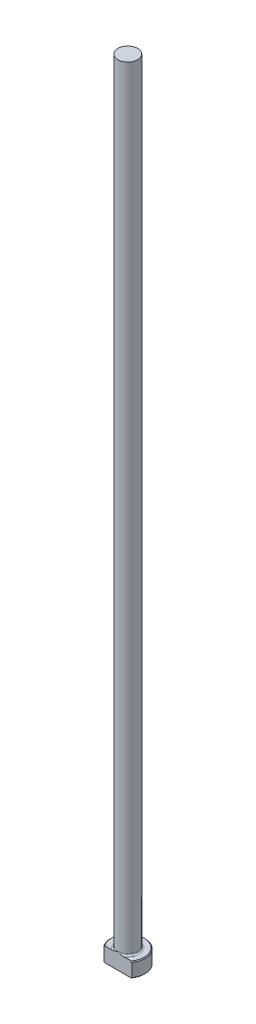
ISO-10303-21;
HEADER;
FILE_DESCRIPTION(('STEP AP214'),'2;1');
FILE_NAME('part.step','',(''),(''),'','','');
FILE_SCHEMA(('AUTOMOTIVE_DESIGN { 1 0 10303 214 1 1 1 1 }'));
ENDSEC;
DATA;
#1=APPLICATION_CONTEXT('core data for automotive mechanical design processes');
#2=APPLICATION_PROTOCOL_DEFINITION('international standard','automotive_design',2000,#1);
#3=PRODUCT_CONTEXT('',#1,'mechanical');
#4=PRODUCT('Part','Part','',(#3));
#5=PRODUCT_RELATED_PRODUCT_CATEGORY('part','',(#4));
#6=PRODUCT_DEFINITION_FORMATION('','',#4);
#7=PRODUCT_DEFINITION_CONTEXT('part definition',#1,'design');
#8=PRODUCT_DEFINITION('design','',#6,#7);
#9=PRODUCT_DEFINITION_SHAPE('','',#8);
#10=(LENGTH_UNIT() NAMED_UNIT(*) SI_UNIT(.MILLI.,.METRE.));
#11=(NAMED_UNIT(*) PLANE_ANGLE_UNIT() SI_UNIT($,.RADIAN.));
#12=(NAMED_UNIT(*) SI_UNIT($,.STERADIAN.) SOLID_ANGLE_UNIT());
#13=UNCERTAINTY_MEASURE_WITH_UNIT(LENGTH_MEASURE(1.E-05),#10,'distance_accuracy_value','');
#14=(GEOMETRIC_REPRESENTATION_CONTEXT(3) GLOBAL_UNCERTAINTY_ASSIGNED_CONTEXT((#13)) GLOBAL_UNIT_ASSIGNED_CONTEXT((#10,
#11,#12)) REPRESENTATION_CONTEXT('',''));
#15=CARTESIAN_POINT('',(0.,0.,0.));
#16=DIRECTION('',(0.,0.,1.));
#17=DIRECTION('',(1.,0.,0.));
#18=AXIS2_PLACEMENT_3D('',#15,#16,#17);
#19=CARTESIAN_POINT('',(0.,0.,0.));
#20=DIRECTION('',(0.,-1.,0.));
#21=DIRECTION('',(0.,0.,-1.));
#22=AXIS2_PLACEMENT_3D('',#19,#20,#21);
#23=PLANE('',#22);
#24=CARTESIAN_POINT('',(0.,0.,0.));
#25=DIRECTION('',(0.,-1.,0.));
#26=DIRECTION('',(0.,0.,-1.));
#27=AXIS2_PLACEMENT_3D('',#24,#25,#26);
#28=CIRCLE('',#27,5.29589999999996);
#29=CARTESIAN_POINT('',(-4.23862381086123,0.,3.17499999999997));
#30=VERTEX_POINT('',#29);
#31=CARTESIAN_POINT('',(4.23862381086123,0.,3.17499999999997));
#32=VERTEX_POINT('',#31);
#33=EDGE_CURVE('E98',#30,#32,#28,.T.);
#34=ORIENTED_EDGE('',*,*,#33,.T.);
#35=DIRECTION('',(-1.,0.,0.));
#36=VECTOR('',#35,1.);
#37=CARTESIAN_POINT('',(-4.55200670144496,0.,3.17499999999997));
#38=LINE('',#37,#36);
#39=EDGE_CURVE('E83',#32,#30,#38,.T.);
#40=ORIENTED_EDGE('',*,*,#39,.T.);
#41=EDGE_LOOP('',(#34,#40));
#42=FACE_BOUND('',#41,.T.);
#43=ADVANCED_FACE('F32',(#42),#23,.T.);
#44=CARTESIAN_POINT('',(0.,259.958771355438,0.));
#45=DIRECTION('',(0.,1.,0.));
#46=DIRECTION('',(0.,0.,1.));
#47=AXIS2_PLACEMENT_3D('',#44,#45,#46);
#48=CYLINDRICAL_SURFACE('',#47,5.54989999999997);
#49=CARTESIAN_POINT('',(0.,4.49580000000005,0.));
#50=DIRECTION('',(0.,1.,0.));
#51=DIRECTION('',(0.,0.,1.));
#52=AXIS2_PLACEMENT_3D('',#49,#50,#51);
#53=CIRCLE('',#52,5.54989999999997);
#54=CARTESIAN_POINT('',(-4.55200670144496,4.49580000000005,3.17499999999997));
#55=VERTEX_POINT('',#54);
#56=CARTESIAN_POINT('',(4.55200670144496,4.49580000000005,3.17499999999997));
#57=VERTEX_POINT('',#56);
#58=EDGE_CURVE('E104',#55,#57,#53,.F.);
#59=ORIENTED_EDGE('',*,*,#58,.T.);
#60=DIRECTION('',(0.,-1.,0.));
#61=VECTOR('',#60,1.);
#62=CARTESIAN_POINT('',(4.55200670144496,254.,3.17499999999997));
#63=LINE('',#62,#61);
#64=CARTESIAN_POINT('',(4.55200670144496,0.253999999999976,3.17499999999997));
#65=VERTEX_POINT('',#64);
#66=EDGE_CURVE('E183',#57,#65,#63,.T.);
#67=ORIENTED_EDGE('',*,*,#66,.T.);
#68=CARTESIAN_POINT('',(0.,0.253999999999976,0.));
#69=DIRECTION('',(0.,-1.,0.));
#70=DIRECTION('',(0.,0.,-1.));
#71=AXIS2_PLACEMENT_3D('',#68,#69,#70);
#72=CIRCLE('',#71,5.54989999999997);
#73=CARTESIAN_POINT('',(-4.55200670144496,0.253999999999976,3.17499999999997));
#74=VERTEX_POINT('',#73);
#75=EDGE_CURVE('E100',#65,#74,#72,.F.);
#76=ORIENTED_EDGE('',*,*,#75,.T.);
#77=DIRECTION('',(0.,-1.,0.));
#78=VECTOR('',#77,1.);
#79=CARTESIAN_POINT('',(-4.55200670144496,254.,3.17499999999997));
#80=LINE('',#79,#78);
#81=EDGE_CURVE('E93',#55,#74,#80,.T.);
#82=ORIENTED_EDGE('',*,*,#81,.F.);
#83=EDGE_LOOP('',(#59,#67,#76,#82));
#84=FACE_BOUND('',#83,.T.);
#85=ADVANCED_FACE('F158',(#84),#48,.T.);
#86=CARTESIAN_POINT('',(-5.54989999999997,4.7498,0.));
#87=DIRECTION('',(0.,1.,0.));
#88=DIRECTION('',(0.,0.,1.));
#89=AXIS2_PLACEMENT_3D('',#86,#87,#88);
#90=PLANE('',#89);
#91=CARTESIAN_POINT('',(0.,4.7498,0.));
#92=DIRECTION('',(0.,1.,0.));
#93=DIRECTION('',(0.,0.,1.));
#94=AXIS2_PLACEMENT_3D('',#91,#92,#93);
#95=CIRCLE('',#94,5.29590000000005);
#96=CARTESIAN_POINT('',(4.23862381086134,4.7498,3.17499999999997));
#97=VERTEX_POINT('',#96);
#98=CARTESIAN_POINT('',(-4.23862381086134,4.7498,3.17499999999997));
#99=VERTEX_POINT('',#98);
#100=EDGE_CURVE('E178',#97,#99,#95,.T.);
#101=ORIENTED_EDGE('',*,*,#100,.T.);
#102=DIRECTION('',(1.,0.,0.));
#103=VECTOR('',#102,1.);
#104=CARTESIAN_POINT('',(-5.54989999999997,4.7498,3.17499999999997));
#105=LINE('',#104,#103);
#106=CARTESIAN_POINT('',(-1.86651118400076,4.74979999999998,3.17499999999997));
#107=VERTEX_POINT('',#106);
#108=EDGE_CURVE('E57',#99,#107,#105,.T.);
#109=ORIENTED_EDGE('',*,*,#108,.T.);
#110=CARTESIAN_POINT('',(0.,4.7498,0.));
#111=DIRECTION('',(0.,1.,0.));
#112=DIRECTION('',(0.,0.,1.));
#113=AXIS2_PLACEMENT_3D('',#110,#111,#112);
#114=CIRCLE('',#113,3.68299999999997);
#115=CARTESIAN_POINT('',(1.86651118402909,4.74979999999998,3.17499999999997));
#116=VERTEX_POINT('',#115);
#117=EDGE_CURVE('E107',#107,#116,#114,.F.);
#118=ORIENTED_EDGE('',*,*,#117,.T.);
#119=EDGE_CURVE('E136',#116,#97,#105,.T.);
#120=ORIENTED_EDGE('',*,*,#119,.T.);
#121=EDGE_LOOP('',(#101,#109,#118,#120));
#122=FACE_BOUND('',#121,.T.);
#123=ADVANCED_FACE('F147',(#122),#90,.T.);
#124=CARTESIAN_POINT('',(0.,4.74980000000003,0.));
#125=DIRECTION('',(0.,-1.,0.));
#126=DIRECTION('',(0.,0.,-1.));
#127=AXIS2_PLACEMENT_3D('',#124,#125,#126);
#128=CONICAL_SURFACE('',#127,5.29590000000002,0.785398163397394);
#129=ORIENTED_EDGE('',*,*,#58,.F.);
#130=CARTESIAN_POINT('',(-10.0167402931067,-0.462188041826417,3.17499999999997));
#131=CARTESIAN_POINT('',(-9.83956615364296,-0.29329908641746,3.17499999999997));
#132=CARTESIAN_POINT('',(-9.66219175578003,-0.124620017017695,3.17499999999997));
#133=CARTESIAN_POINT('',(-9.3069644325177,0.212235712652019,3.17499999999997));
#134=CARTESIAN_POINT('',(-9.12911150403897,0.380412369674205,3.17499999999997));
#135=CARTESIAN_POINT('',(-8.59460771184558,0.88416858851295,3.17499999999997));
#136=CARTESIAN_POINT('',(-8.23712475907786,1.21886656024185,3.17499999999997));
#137=CARTESIAN_POINT('',(-7.51548848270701,1.88820774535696,3.17499999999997));
#138=CARTESIAN_POINT('',(-7.15130415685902,2.22281765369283,3.17499999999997));
#139=CARTESIAN_POINT('',(-6.60150494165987,2.72077471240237,3.17499999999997));
#140=CARTESIAN_POINT('',(-6.41766956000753,2.88608479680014,3.17499999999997));
#141=CARTESIAN_POINT('',(-6.04850874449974,3.21502923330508,3.17499999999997));
#142=CARTESIAN_POINT('',(-5.86318332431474,3.37866360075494,3.17499999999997));
#143=CARTESIAN_POINT('',(-5.42475636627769,3.76132794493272,3.17499999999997));
#144=CARTESIAN_POINT('',(-5.17087613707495,3.97947167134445,3.17499999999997));
#145=CARTESIAN_POINT('',(-4.78637219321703,4.30242579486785,3.17499999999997));
#146=CARTESIAN_POINT('',(-4.65755933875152,4.40939174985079,3.17499999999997));
#147=CARTESIAN_POINT('',(-4.39846835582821,4.6215318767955,3.17499999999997));
#148=CARTESIAN_POINT('',(-4.26819026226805,4.72670609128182,3.17499999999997));
#149=CARTESIAN_POINT('',(-4.00614386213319,4.93458819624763,3.17499999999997));
#150=CARTESIAN_POINT('',(-3.87437946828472,5.0373010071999,3.17499999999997));
#151=CARTESIAN_POINT('',(-3.60868880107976,5.23988426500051,3.17499999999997));
#152=CARTESIAN_POINT('',(-3.47476266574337,5.33975489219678,3.17499999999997));
#153=CARTESIAN_POINT('',(-3.20432566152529,5.53575009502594,3.17499999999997));
#154=CARTESIAN_POINT('',(-3.06781662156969,5.63187718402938,3.17499999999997));
#155=CARTESIAN_POINT('',(-2.79150743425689,5.81925786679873,3.17499999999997));
#156=CARTESIAN_POINT('',(-2.65170798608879,5.91051248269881,3.17499999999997));
#157=CARTESIAN_POINT('',(-2.40080357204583,6.06610461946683,3.17499999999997));
#158=CARTESIAN_POINT('',(-2.29053645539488,6.13178781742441,3.17499999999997));
#159=CARTESIAN_POINT('',(-2.06714717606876,6.25818980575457,3.17499999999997));
#160=CARTESIAN_POINT('',(-1.95402458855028,6.31890785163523,3.17499999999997));
#161=CARTESIAN_POINT('',(-1.72463633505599,6.43389240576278,3.17499999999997));
#162=CARTESIAN_POINT('',(-1.60837338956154,6.48816429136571,3.17499999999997));
#163=CARTESIAN_POINT('',(-1.37232485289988,6.58846115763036,3.17499999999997));
#164=CARTESIAN_POINT('',(-1.25254039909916,6.63448876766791,3.17499999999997));
#165=CARTESIAN_POINT('',(-1.03847127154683,6.70631999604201,3.17499999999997));
#166=CARTESIAN_POINT('',(-0.944930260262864,6.73432823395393,3.17499999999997));
#167=CARTESIAN_POINT('',(-0.75601186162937,6.78320653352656,3.17499999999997));
#168=CARTESIAN_POINT('',(-0.660635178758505,6.80407927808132,3.17499999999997));
#169=CARTESIAN_POINT('',(-0.46875225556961,6.83766834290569,3.17499999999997));
#170=CARTESIAN_POINT('',(-0.372250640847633,6.85041070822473,3.17499999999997));
#171=CARTESIAN_POINT('',(-0.178484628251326,6.86715141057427,3.17499999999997));
#172=CARTESIAN_POINT('',(-0.0812202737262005,6.87115024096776,3.17499999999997));
#173=CARTESIAN_POINT('',(0.113557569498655,6.87016742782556,3.17499999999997));
#174=CARTESIAN_POINT('',(0.211070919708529,6.86515852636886,3.17499999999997));
#175=CARTESIAN_POINT('',(0.405245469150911,6.84640245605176,3.17499999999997));
#176=CARTESIAN_POINT('',(0.501906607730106,6.83265467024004,3.17499999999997));
#177=CARTESIAN_POINT('',(0.694033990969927,6.79710670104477,3.17499999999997));
#178=CARTESIAN_POINT('',(0.789495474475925,6.77528112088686,3.17499999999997));
#179=CARTESIAN_POINT('',(0.978501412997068,6.72458544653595,3.17499999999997));
#180=CARTESIAN_POINT('',(1.07204574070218,6.69571488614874,3.17499999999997));
#181=CARTESIAN_POINT('',(1.36820011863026,6.59374975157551,3.17499999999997));
#182=CARTESIAN_POINT('',(1.56688529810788,6.50918166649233,3.17499999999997));
#183=CARTESIAN_POINT('',(1.85781194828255,6.36807703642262,3.17499999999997));
#184=CARTESIAN_POINT('',(1.95370879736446,6.3186024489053,3.17499999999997));
#185=CARTESIAN_POINT('',(2.14339771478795,6.21576230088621,3.17499999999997));
#186=CARTESIAN_POINT('',(2.23719011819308,6.16239736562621,3.17499999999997));
#187=CARTESIAN_POINT('',(2.42421725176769,6.05174311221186,3.17499999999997));
#188=CARTESIAN_POINT('',(2.5174250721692,5.99440876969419,3.17499999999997));
#189=CARTESIAN_POINT('',(2.7021637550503,5.87710026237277,3.17499999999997));
#190=CARTESIAN_POINT('',(2.79369457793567,5.81712603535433,3.17499999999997));
#191=CARTESIAN_POINT('',(2.97520639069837,5.69507129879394,3.17499999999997));
#192=CARTESIAN_POINT('',(3.06518880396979,5.63299289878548,3.17499999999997));
#193=CARTESIAN_POINT('',(3.24388392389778,5.50704415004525,3.17499999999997));
#194=CARTESIAN_POINT('',(3.33259666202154,5.44317384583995,3.17499999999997));
#195=CARTESIAN_POINT('',(3.57597346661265,5.26479758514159,3.17499999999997));
#196=CARTESIAN_POINT('',(3.72948709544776,5.14872224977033,3.17499999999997));
#197=CARTESIAN_POINT('',(4.03385257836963,4.91312427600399,3.17499999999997));
#198=CARTESIAN_POINT('',(4.18470417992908,4.79360131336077,3.17499999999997));
#199=CARTESIAN_POINT('',(4.48432539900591,4.5518890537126,3.17499999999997));
#200=CARTESIAN_POINT('',(4.63309438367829,4.42969897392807,3.17499999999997));
#201=CARTESIAN_POINT('',(4.92891951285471,4.18325994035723,3.17499999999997));
#202=CARTESIAN_POINT('',(5.07597561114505,4.05901093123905,3.17499999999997));
#203=CARTESIAN_POINT('',(5.51556942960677,3.68340723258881,3.17499999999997));
#204=CARTESIAN_POINT('',(5.80602157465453,3.42961335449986,3.17499999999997));
#205=CARTESIAN_POINT('',(6.38307996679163,2.91781719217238,3.17499999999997));
#206=CARTESIAN_POINT('',(6.66968688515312,2.65981566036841,3.17499999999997));
#207=CARTESIAN_POINT('',(7.21375125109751,2.16488107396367,3.17499999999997));
#208=CARTESIAN_POINT('',(7.47144859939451,1.92821133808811,3.17499999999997));
#209=CARTESIAN_POINT('',(7.98516371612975,1.45303114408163,3.17499999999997));
#210=CARTESIAN_POINT('',(8.24118139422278,1.21452058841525,3.17499999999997));
#211=CARTESIAN_POINT('',(8.75104638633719,0.736915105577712,3.17499999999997));
#212=CARTESIAN_POINT('',(9.00489811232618,0.497824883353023,3.17499999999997));
#213=CARTESIAN_POINT('',(9.51154344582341,0.0185627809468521,3.17499999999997));
#214=CARTESIAN_POINT('',(9.76433712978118,-0.221609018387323,3.17499999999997));
#215=CARTESIAN_POINT('',(10.0167402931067,-0.462188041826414,3.17499999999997));
#216=B_SPLINE_CURVE_WITH_KNOTS('',3,(#130,#131,#132,#133,#134,#135,#136,#137,#138,#139,#140,
#141,#142,#143,#144,#145,#146,#147,#148,#149,#150,#151,#152,#153,#154,#155,#156,#157,#158,#159,
#160,#161,#162,#163,#164,#165,#166,#167,#168,#169,#170,#171,#172,#173,#174,#175,#176,#177,#178,
#179,#180,#181,#182,#183,#184,#185,#186,#187,#188,#189,#190,#191,#192,#193,#194,#195,#196,#197,
#198,#199,#200,#201,#202,#203,#204,#205,#206,#207,#208,#209,#210,#211,#212,#213,#214,#215),
.UNSPECIFIED.,.F.,.F.,(4,2,2,2,2,2,2,2,2,2,2,2,2,2,2,2,2,2,2,2,2,2,2,2,2,2,2,2,2,2,2,2,2,2,2,2,
2,2,2,2,2,2,4),(0.,0.734320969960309,1.46864667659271,2.93776649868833,4.4214216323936,
5.16310419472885,5.90477996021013,6.90888979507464,7.41118265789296,7.9134635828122,
8.41463858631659,8.9157817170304,9.41658237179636,9.9172775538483,10.3022224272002,
10.68722491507,11.0719039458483,11.4564600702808,11.7491569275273,12.0417436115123,
12.3333882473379,12.6250164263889,12.9175285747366,13.2100613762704,13.5035218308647,
13.7970017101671,14.4429112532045,14.7666018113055,15.0902404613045,15.4184826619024,
15.7467326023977,16.0746626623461,16.4025845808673,16.9798839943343,17.5572378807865,
18.1347635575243,18.7123047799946,19.8693665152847,21.0262235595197,22.0758708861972,
23.1255742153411,24.1717271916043,25.2178032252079),.UNSPECIFIED.);
#217=EDGE_CURVE('E135',#55,#99,#216,.T.);
#218=ORIENTED_EDGE('',*,*,#217,.T.);
#219=ORIENTED_EDGE('',*,*,#100,.F.);
#220=EDGE_CURVE('E127',#97,#57,#216,.T.);
#221=ORIENTED_EDGE('',*,*,#220,.T.);
#222=EDGE_LOOP('',(#129,#218,#219,#221));
#223=FACE_BOUND('',#222,.T.);
#224=ADVANCED_FACE('F143',(#223),#128,.T.);
#225=CARTESIAN_POINT('',(0.,0.253999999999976,0.));
#226=DIRECTION('',(0.,1.,0.));
#227=DIRECTION('',(0.,0.,1.));
#228=AXIS2_PLACEMENT_3D('',#225,#226,#227);
#229=CONICAL_SURFACE('',#228,5.54989999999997,0.785398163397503);
#230=ORIENTED_EDGE('',*,*,#75,.F.);
#231=CARTESIAN_POINT('',(10.0167402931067,5.21198804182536,3.17499999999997));
#232=CARTESIAN_POINT('',(9.83956615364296,5.04309908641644,3.17499999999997));
#233=CARTESIAN_POINT('',(9.66219175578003,4.87442001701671,3.17499999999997));
#234=CARTESIAN_POINT('',(9.3069644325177,4.53756428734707,3.17499999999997));
#235=CARTESIAN_POINT('',(9.12911150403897,4.36938763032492,3.17499999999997));
#236=CARTESIAN_POINT('',(8.59460771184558,3.86563141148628,3.17499999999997));
#237=CARTESIAN_POINT('',(8.23712475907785,3.53093343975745,3.17499999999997));
#238=CARTESIAN_POINT('',(7.515488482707,2.8615922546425,3.17499999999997));
#239=CARTESIAN_POINT('',(7.15130415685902,2.5269823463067,3.17499999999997));
#240=CARTESIAN_POINT('',(6.60150494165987,2.02902528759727,3.17499999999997));
#241=CARTESIAN_POINT('',(6.41766956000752,1.86371520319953,3.17499999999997));
#242=CARTESIAN_POINT('',(6.04850874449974,1.53477076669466,3.17499999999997));
#243=CARTESIAN_POINT('',(5.86318332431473,1.37113639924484,3.17499999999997));
#244=CARTESIAN_POINT('',(5.42475636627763,0.988472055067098,3.17499999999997));
#245=CARTESIAN_POINT('',(5.17087613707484,0.770328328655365,3.17499999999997));
#246=CARTESIAN_POINT('',(4.78637219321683,0.447374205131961,3.17499999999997));
#247=CARTESIAN_POINT('',(4.65755933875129,0.340408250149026,3.17499999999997));
#248=CARTESIAN_POINT('',(4.39846835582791,0.128268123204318,3.17499999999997));
#249=CARTESIAN_POINT('',(4.26819026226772,0.0230939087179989,3.17499999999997));
#250=CARTESIAN_POINT('',(4.0061438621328,-0.184788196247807,3.17499999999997));
#251=CARTESIAN_POINT('',(3.8743794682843,-0.28750100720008,3.17499999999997));
#252=CARTESIAN_POINT('',(3.60868880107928,-0.490084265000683,3.17499999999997));
#253=CARTESIAN_POINT('',(3.47476266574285,-0.589954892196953,3.17499999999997));
#254=CARTESIAN_POINT('',(3.20432566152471,-0.785950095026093,3.17499999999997));
#255=CARTESIAN_POINT('',(3.06781662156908,-0.882077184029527,3.17499999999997));
#256=CARTESIAN_POINT('',(2.79150743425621,-1.06945786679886,3.17499999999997));
#257=CARTESIAN_POINT('',(2.65170798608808,-1.16071248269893,3.17499999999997));
#258=CARTESIAN_POINT('',(2.40080357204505,-1.31630461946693,3.17499999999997));
#259=CARTESIAN_POINT('',(2.29053645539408,-1.38198781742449,3.17499999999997));
#260=CARTESIAN_POINT('',(2.0671471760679,-1.50838980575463,3.17499999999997));
#261=CARTESIAN_POINT('',(1.95402458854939,-1.56910785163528,3.17499999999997));
#262=CARTESIAN_POINT('',(1.72463633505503,-1.68409240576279,3.17499999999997));
#263=CARTESIAN_POINT('',(1.60837338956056,-1.7383642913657,3.17499999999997));
#264=CARTESIAN_POINT('',(1.37232485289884,-1.83866115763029,3.17499999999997));
#265=CARTESIAN_POINT('',(1.25254039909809,-1.88468876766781,3.17499999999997));
#266=CARTESIAN_POINT('',(1.03847127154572,-1.95651999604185,3.17499999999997));
#267=CARTESIAN_POINT('',(0.94493026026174,-1.98452823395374,3.17499999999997));
#268=CARTESIAN_POINT('',(0.756011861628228,-2.0334065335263,3.17499999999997));
#269=CARTESIAN_POINT('',(0.660635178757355,-2.05427927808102,3.17499999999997));
#270=CARTESIAN_POINT('',(0.468752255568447,-2.08786834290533,3.17499999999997));
#271=CARTESIAN_POINT('',(0.372250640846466,-2.10061070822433,3.17499999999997));
#272=CARTESIAN_POINT('',(0.178484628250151,-2.11735141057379,3.17499999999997));
#273=CARTESIAN_POINT('',(0.0812202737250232,-2.12135024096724,3.17499999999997));
#274=CARTESIAN_POINT('',(-0.11355756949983,-2.12036742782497,3.17499999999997));
#275=CARTESIAN_POINT('',(-0.211070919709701,-2.11535852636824,3.17499999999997));
#276=CARTESIAN_POINT('',(-0.405245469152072,-2.09660245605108,3.17499999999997));
#277=CARTESIAN_POINT('',(-0.501906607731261,-2.08285467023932,3.17499999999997));
#278=CARTESIAN_POINT('',(-0.694033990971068,-2.047306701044,3.17499999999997));
#279=CARTESIAN_POINT('',(-0.789495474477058,-2.02548112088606,3.17499999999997));
#280=CARTESIAN_POINT('',(-0.978501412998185,-1.9747854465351,3.17499999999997));
#281=CARTESIAN_POINT('',(-1.07204574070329,-1.94591488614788,3.17499999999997));
#282=CARTESIAN_POINT('',(-1.36820011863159,-1.84394975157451,3.17499999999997));
#283=CARTESIAN_POINT('',(-1.56688529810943,-1.75938166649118,3.17499999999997));
#284=CARTESIAN_POINT('',(-1.85781194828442,-1.61827703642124,3.17499999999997));
#285=CARTESIAN_POINT('',(-1.95370879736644,-1.56880244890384,3.17499999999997));
#286=CARTESIAN_POINT('',(-2.14339771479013,-1.46596230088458,3.17499999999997));
#287=CARTESIAN_POINT('',(-2.23719011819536,-1.4125973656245,3.17499999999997));
#288=CARTESIAN_POINT('',(-2.42421725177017,-1.30194311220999,3.17499999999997));
#289=CARTESIAN_POINT('',(-2.51742507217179,-1.24460876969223,3.17499999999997));
#290=CARTESIAN_POINT('',(-2.70216375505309,-1.12730026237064,3.17499999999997));
#291=CARTESIAN_POINT('',(-2.79369457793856,-1.06732603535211,3.17499999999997));
#292=CARTESIAN_POINT('',(-2.97520639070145,-0.945271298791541,3.17499999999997));
#293=CARTESIAN_POINT('',(-3.06518880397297,-0.883192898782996,3.17499999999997));
#294=CARTESIAN_POINT('',(-3.24388392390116,-0.757244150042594,3.17499999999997));
#295=CARTESIAN_POINT('',(-3.33259666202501,-0.693373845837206,3.17499999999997));
#296=CARTESIAN_POINT('',(-3.57597346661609,-0.51499758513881,3.17499999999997));
#297=CARTESIAN_POINT('',(-3.72948709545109,-0.398922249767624,3.17499999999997));
#298=CARTESIAN_POINT('',(-4.03385257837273,-0.163324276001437,3.17499999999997));
#299=CARTESIAN_POINT('',(-4.18470417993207,-0.0438013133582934,3.17499999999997));
#300=CARTESIAN_POINT('',(-4.48432539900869,0.197910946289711,3.17499999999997));
#301=CARTESIAN_POINT('',(-4.63309438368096,0.320101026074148,3.17499999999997));
#302=CARTESIAN_POINT('',(-4.92891951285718,0.566540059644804,3.17499999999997));
#303=CARTESIAN_POINT('',(-5.07597561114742,0.690789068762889,3.17499999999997));
#304=CARTESIAN_POINT('',(-5.51556942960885,1.06639276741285,3.17499999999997));
#305=CARTESIAN_POINT('',(-5.80602157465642,1.32018664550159,3.17499999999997));
#306=CARTESIAN_POINT('',(-6.38307996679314,1.83198280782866,3.17499999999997));
#307=CARTESIAN_POINT('',(-6.66968688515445,2.08998433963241,3.17499999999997));
#308=CARTESIAN_POINT('',(-7.21375125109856,2.58491892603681,3.17499999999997));
#309=CARTESIAN_POINT('',(-7.47144859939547,2.82158866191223,3.17499999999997));
#310=CARTESIAN_POINT('',(-7.9851637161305,3.29676885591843,3.17499999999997));
#311=CARTESIAN_POINT('',(-8.24118139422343,3.53527941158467,3.17499999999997));
#312=CARTESIAN_POINT('',(-8.75104638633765,4.01288489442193,3.17499999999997));
#313=CARTESIAN_POINT('',(-9.00489811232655,4.25197511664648,3.17499999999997));
#314=CARTESIAN_POINT('',(-9.5115434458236,4.73123721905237,3.17499999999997));
#315=CARTESIAN_POINT('',(-9.76433712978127,4.97140901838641,3.17499999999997));
#316=CARTESIAN_POINT('',(-10.0167402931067,5.21198804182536,3.17499999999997));
#317=B_SPLINE_CURVE_WITH_KNOTS('',3,(#231,#232,#233,#234,#235,#236,#237,#238,#239,#240,#241,
#242,#243,#244,#245,#246,#247,#248,#249,#250,#251,#252,#253,#254,#255,#256,#257,#258,#259,#260,
#261,#262,#263,#264,#265,#266,#267,#268,#269,#270,#271,#272,#273,#274,#275,#276,#277,#278,#279,
#280,#281,#282,#283,#284,#285,#286,#287,#288,#289,#290,#291,#292,#293,#294,#295,#296,#297,#298,
#299,#300,#301,#302,#303,#304,#305,#306,#307,#308,#309,#310,#311,#312,#313,#314,#315,#316),
.UNSPECIFIED.,.F.,.F.,(4,2,2,2,2,2,2,2,2,2,2,2,2,2,2,2,2,2,2,2,2,2,2,2,2,2,2,2,2,2,2,2,2,2,2,2,
2,2,2,2,2,2,4),(0.,0.734320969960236,1.46864667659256,2.93776649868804,4.42142163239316,
5.16310419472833,5.90477996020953,6.90888979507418,7.41118265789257,7.91346358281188,
8.41463858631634,8.91578171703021,9.41658237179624,9.91727755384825,10.3022224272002,
10.68722491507,11.0719039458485,11.4564600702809,11.7491569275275,12.0417436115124,
12.333388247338,12.625016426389,12.9175285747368,13.2100613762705,13.5035218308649,
13.7970017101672,14.4429112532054,14.7666018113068,15.0902404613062,15.4184826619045,
15.7467326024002,16.074662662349,16.4025845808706,16.9798839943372,17.557237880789,
18.1347635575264,18.7123047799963,19.8693665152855,21.0262235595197,22.0758708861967,
23.12557421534,24.1717271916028,25.2178032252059),.UNSPECIFIED.);
#318=EDGE_CURVE('E86',#65,#32,#317,.T.);
#319=ORIENTED_EDGE('',*,*,#318,.T.);
#320=ORIENTED_EDGE('',*,*,#33,.F.);
#321=EDGE_CURVE('E89',#30,#74,#317,.T.);
#322=ORIENTED_EDGE('',*,*,#321,.T.);
#323=EDGE_LOOP('',(#230,#319,#320,#322));
#324=FACE_BOUND('',#323,.T.);
#325=ADVANCED_FACE('F97',(#324),#229,.T.);
#326=CARTESIAN_POINT('',(0.,5.25779999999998,0.));
#327=DIRECTION('',(0.,1.,0.));
#328=DIRECTION('',(0.,0.,1.));
#329=AXIS2_PLACEMENT_3D('',#326,#327,#328);
#330=TOROIDAL_SURFACE('',#329,3.68299999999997,0.508);
#331=CARTESIAN_POINT('',(0.,5.25779999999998,3.17499999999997));
#332=CARTESIAN_POINT('',(1.80769053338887E-10,5.25780081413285,3.17499999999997));
#333=CARTESIAN_POINT('',(1.73023885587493E-07,5.25780162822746,3.17499999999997));
#334=CARTESIAN_POINT('',(7.19628533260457E-07,5.25780319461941,3.17499999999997));
#335=CARTESIAN_POINT('',(1.09883574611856E-06,5.25780394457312,3.17499999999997));
#336=CARTESIAN_POINT('',(2.00966877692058E-06,5.25780544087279,3.17499999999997));
#337=CARTESIAN_POINT('',(2.55212990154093E-06,5.25780618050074,3.17499999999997));
#338=CARTESIAN_POINT('',(3.72136332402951E-06,5.25780757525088,3.17499999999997));
#339=CARTESIAN_POINT('',(4.34736599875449E-06,5.25780823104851,3.17499999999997));
#340=CARTESIAN_POINT('',(6.59438229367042E-06,5.25781043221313,3.17499999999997));
#341=CARTESIAN_POINT('',(8.32481538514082E-06,5.25781186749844,3.17499999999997));
#342=CARTESIAN_POINT('',(1.18988287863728E-05,5.25781442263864,3.17499999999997));
#343=CARTESIAN_POINT('',(1.37358815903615E-05,5.25781555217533,3.17499999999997));
#344=CARTESIAN_POINT('',(2.09135300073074E-05,5.25781980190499,3.17499999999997));
#345=CARTESIAN_POINT('',(2.63912469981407E-05,5.25782270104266,3.17499999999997));
#346=CARTESIAN_POINT('',(3.71867761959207E-05,5.25782743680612,3.17499999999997));
#347=CARTESIAN_POINT('',(4.24736618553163E-05,5.25782934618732,3.17499999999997));
#348=CARTESIAN_POINT('',(6.50188365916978E-05,5.25783746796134,3.17499999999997));
#349=CARTESIAN_POINT('',(8.22815781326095E-05,5.25784363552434,3.17499999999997));
#350=CARTESIAN_POINT('',(0.000114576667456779,5.25785352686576,3.17499999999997));
#351=CARTESIAN_POINT('',(0.000129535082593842,5.25785748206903,3.17499999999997));
#352=CARTESIAN_POINT('',(0.000238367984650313,5.25788883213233,3.17499999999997));
#353=CARTESIAN_POINT('',(0.000328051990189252,5.25792882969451,3.17499999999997));
#354=CARTESIAN_POINT('',(0.000676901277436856,5.25807871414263,3.17499999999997));
#355=CARTESIAN_POINT('',(0.000938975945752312,5.25817923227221,3.17499999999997));
#356=CARTESIAN_POINT('',(0.001957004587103,5.25857549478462,3.17499999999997));
#357=CARTESIAN_POINT('',(0.00270997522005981,5.25888105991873,3.17499999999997));
#358=CARTESIAN_POINT('',(0.00579427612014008,5.26012678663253,3.17499999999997));
#359=CARTESIAN_POINT('',(0.00812889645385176,5.26105588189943,3.17499999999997));
#360=CARTESIAN_POINT('',(0.0536737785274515,5.27918868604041,3.17499999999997));
#361=CARTESIAN_POINT('',(0.0968493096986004,5.29651116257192,3.17499999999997));
#362=CARTESIAN_POINT('',(0.181675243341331,5.33030366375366,3.17499999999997));
#363=CARTESIAN_POINT('',(0.22332279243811,5.34678146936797,3.17499999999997));
#364=CARTESIAN_POINT('',(0.311600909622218,5.38141206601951,3.17499999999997));
#365=CARTESIAN_POINT('',(0.358243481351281,5.39953485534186,3.17499999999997));
#366=CARTESIAN_POINT('',(0.452199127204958,5.43546002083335,3.17499999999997));
#367=CARTESIAN_POINT('',(0.499514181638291,5.4532572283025,3.17499999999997));
#368=CARTESIAN_POINT('',(0.581915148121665,5.48356219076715,3.17499999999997));
#369=CARTESIAN_POINT('',(0.616942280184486,5.49622931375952,3.17499999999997));
#370=CARTESIAN_POINT('',(0.687074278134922,5.52107238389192,3.17499999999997));
#371=CARTESIAN_POINT('',(0.722178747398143,5.53324945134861,3.17499999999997));
#372=CARTESIAN_POINT('',(0.82617821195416,5.56842938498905,3.17499999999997));
#373=CARTESIAN_POINT('',(0.895335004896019,5.59066808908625,3.17499999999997));
#374=CARTESIAN_POINT('',(1.04440355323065,5.63534989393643,3.17499999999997));
#375=CARTESIAN_POINT('',(1.12444395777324,5.65737079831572,3.17499999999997));
#376=CARTESIAN_POINT('',(1.28636529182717,5.69671209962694,3.17499999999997));
#377=CARTESIAN_POINT('',(1.36825573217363,5.71399428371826,3.17499999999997));
#378=CARTESIAN_POINT('',(1.53827501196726,5.74289044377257,3.17499999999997));
#379=CARTESIAN_POINT('',(1.6264772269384,5.754089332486,3.17499999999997));
#380=CARTESIAN_POINT('',(1.80336979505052,5.766538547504,3.17499999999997));
#381=CARTESIAN_POINT('',(1.89205668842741,5.76782927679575,3.17499999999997));
#382=CARTESIAN_POINT('',(2.04614946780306,5.75829207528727,3.17499999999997));
#383=CARTESIAN_POINT('',(2.1117267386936,5.7504696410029,3.17499999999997));
#384=CARTESIAN_POINT('',(2.24032569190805,5.72527330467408,3.17499999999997));
#385=CARTESIAN_POINT('',(2.30336992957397,5.70802985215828,3.17499999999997));
#386=CARTESIAN_POINT('',(2.3964725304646,5.67213651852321,3.17499999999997));
#387=CARTESIAN_POINT('',(2.42822079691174,5.65788049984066,3.17499999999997));
#388=CARTESIAN_POINT('',(2.48965433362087,5.62525897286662,3.17499999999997));
#389=CARTESIAN_POINT('',(2.51933677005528,5.60688795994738,3.17499999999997));
#390=CARTESIAN_POINT('',(2.56994777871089,5.56951032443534,3.17499999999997));
#391=CARTESIAN_POINT('',(2.59146237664,5.55130442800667,3.17499999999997));
#392=CARTESIAN_POINT('',(2.63132394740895,5.5117021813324,3.17499999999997));
#393=CARTESIAN_POINT('',(2.64967743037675,5.49031256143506,3.17499999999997));
#394=CARTESIAN_POINT('',(2.67804602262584,5.4500327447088,3.17499999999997));
#395=CARTESIAN_POINT('',(2.6890027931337,5.43180880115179,3.17499999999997));
#396=CARTESIAN_POINT('',(2.7078017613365,5.3938065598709,3.17499999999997));
#397=CARTESIAN_POINT('',(2.71564587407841,5.37402922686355,3.17499999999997));
#398=CARTESIAN_POINT('',(2.72769754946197,5.33322214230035,3.17499999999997));
#399=CARTESIAN_POINT('',(2.73187843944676,5.31218437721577,3.17499999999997));
#400=CARTESIAN_POINT('',(2.73613267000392,5.26969745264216,3.17499999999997));
#401=CARTESIAN_POINT('',(2.73620805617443,5.24824850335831,3.17499999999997));
#402=CARTESIAN_POINT('',(2.73247730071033,5.20813635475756,3.17499999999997));
#403=CARTESIAN_POINT('',(2.72910595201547,5.18943073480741,3.17499999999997));
#404=CARTESIAN_POINT('',(2.71937153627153,5.15282145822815,3.17499999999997));
#405=CARTESIAN_POINT('',(2.71300800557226,5.13491792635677,3.17499999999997));
#406=CARTESIAN_POINT('',(2.69740230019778,5.0996670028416,3.17499999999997));
#407=CARTESIAN_POINT('',(2.68806645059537,5.08236154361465,3.17499999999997));
#408=CARTESIAN_POINT('',(2.66708571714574,5.04922644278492,3.17499999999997));
#409=CARTESIAN_POINT('',(2.65543987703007,5.03339741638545,3.17499999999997));
#410=CARTESIAN_POINT('',(2.62294588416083,4.99450310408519,3.17499999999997));
#411=CARTESIAN_POINT('',(2.60069446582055,4.9726078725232,3.17499999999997));
#412=CARTESIAN_POINT('',(2.55299669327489,4.93259922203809,3.17499999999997));
#413=CARTESIAN_POINT('',(2.52754047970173,4.91449795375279,3.17499999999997));
#414=CARTESIAN_POINT('',(2.46015073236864,4.87290115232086,3.17499999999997));
#415=CARTESIAN_POINT('',(2.41675555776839,4.85178783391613,3.17499999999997));
#416=CARTESIAN_POINT('',(2.32743780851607,4.81642640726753,3.17499999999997));
#417=CARTESIAN_POINT('',(2.28151740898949,4.80217249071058,3.17499999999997));
#418=CARTESIAN_POINT('',(2.19492730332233,4.78086425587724,3.17499999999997));
#419=CARTESIAN_POINT('',(2.15443153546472,4.77307762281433,3.17499999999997));
#420=CARTESIAN_POINT('',(2.07290577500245,4.7609987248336,3.17499999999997));
#421=CARTESIAN_POINT('',(2.03187536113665,4.75670940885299,3.17499999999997));
#422=CARTESIAN_POINT('',(1.90717655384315,4.74822293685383,3.17499999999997));
#423=CARTESIAN_POINT('',(1.82319261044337,4.74868666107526,3.17499999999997));
#424=CARTESIAN_POINT('',(1.62833175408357,4.76032593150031,3.17499999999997));
#425=CARTESIAN_POINT('',(1.51770881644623,4.77497959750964,3.17499999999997));
#426=CARTESIAN_POINT('',(1.29813873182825,4.81534590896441,3.17499999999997));
#427=CARTESIAN_POINT('',(1.18920134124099,4.84110792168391,3.17499999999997));
#428=CARTESIAN_POINT('',(0.982215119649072,4.89780610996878,3.17499999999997));
#429=CARTESIAN_POINT('',(0.883999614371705,4.92815337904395,3.17499999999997));
#430=CARTESIAN_POINT('',(0.689996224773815,4.99284004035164,3.17499999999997));
#431=CARTESIAN_POINT('',(0.594193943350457,5.02713703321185,3.17499999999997));
#432=CARTESIAN_POINT('',(0.464142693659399,5.07567249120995,3.17499999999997));
#433=CARTESIAN_POINT('',(0.429471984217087,5.08880513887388,3.17499999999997));
#434=CARTESIAN_POINT('',(0.359331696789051,5.11568278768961,3.17499999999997));
#435=CARTESIAN_POINT('',(0.323864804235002,5.12943483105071,3.17499999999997));
#436=CARTESIAN_POINT('',(0.263992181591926,5.15284621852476,3.17499999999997));
#437=CARTESIAN_POINT('',(0.239565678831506,5.16245280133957,3.17499999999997));
#438=CARTESIAN_POINT('',(0.190982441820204,5.18164529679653,3.17499999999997));
#439=CARTESIAN_POINT('',(0.166825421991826,5.19123047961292,3.17499999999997));
#440=CARTESIAN_POINT('',(0.121037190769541,5.20943918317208,3.17499999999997));
#441=CARTESIAN_POINT('',(0.0994044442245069,5.21805909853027,3.17499999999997));
#442=CARTESIAN_POINT('',(0.0553410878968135,5.2356763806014,3.17499999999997));
#443=CARTESIAN_POINT('',(0.0329111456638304,5.24467572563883,3.17499999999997));
#444=CARTESIAN_POINT('',(0.00813211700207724,5.25454302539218,3.17499999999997));
#445=CARTESIAN_POINT('',(0.00580062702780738,5.25547072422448,3.17499999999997));
#446=CARTESIAN_POINT('',(0.00271708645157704,5.25671609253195,3.17499999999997));
#447=CARTESIAN_POINT('',(0.00196172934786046,5.25702263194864,3.17499999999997));
#448=CARTESIAN_POINT('',(0.000940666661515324,5.25742007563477,3.17499999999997));
#449=CARTESIAN_POINT('',(0.000677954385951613,5.25752083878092,3.17499999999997));
#450=CARTESIAN_POINT('',(0.000328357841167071,5.25767104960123,3.17499999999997));
#451=CARTESIAN_POINT('',(0.000238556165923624,5.25771109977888,3.17499999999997));
#452=CARTESIAN_POINT('',(0.000129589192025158,5.25774247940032,3.17499999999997));
#453=CARTESIAN_POINT('',(0.000114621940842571,5.25774643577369,3.17499999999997));
#454=CARTESIAN_POINT('',(8.23074123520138E-05,5.25775633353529,3.17499999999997));
#455=CARTESIAN_POINT('',(6.50343069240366E-05,5.25776250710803,3.17499999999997));
#456=CARTESIAN_POINT('',(4.24775013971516E-05,5.25777063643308,3.17499999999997));
#457=CARTESIAN_POINT('',(3.71892385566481E-05,5.25777254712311,3.17499999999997));
#458=CARTESIAN_POINT('',(2.63911145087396E-05,5.25777728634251,3.17499999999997));
#459=CARTESIAN_POINT('',(2.09122302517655E-05,5.25778018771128,3.17499999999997));
#460=CARTESIAN_POINT('',(1.37334835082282E-05,5.25778444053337,3.17499999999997));
#461=CARTESIAN_POINT('',(1.189632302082E-05,5.25778557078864,3.17499999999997));
#462=CARTESIAN_POINT('',(8.32223670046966E-06,5.25778812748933,3.17499999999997));
#463=CARTESIAN_POINT('',(6.59184566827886E-06,5.25778956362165,3.17499999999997));
#464=CARTESIAN_POINT('',(4.34505756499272E-06,5.25779176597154,3.17499999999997));
#465=CARTESIAN_POINT('',(3.71915459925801E-06,5.25779242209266,3.17499999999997));
#466=CARTESIAN_POINT('',(2.55017854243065E-06,5.25779381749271,3.17499999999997));
#467=CARTESIAN_POINT('',(2.00787573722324E-06,5.25779455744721,3.17499999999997));
#468=CARTESIAN_POINT('',(1.09742559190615E-06,5.25779605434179,3.17499999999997));
#469=CARTESIAN_POINT('',(7.18435041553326E-07,5.25779680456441,3.17499999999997));
#470=CARTESIAN_POINT('',(1.72356606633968E-07,5.25779837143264,3.17499999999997));
#471=CARTESIAN_POINT('',(-1.80798290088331E-10,5.25779918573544,3.17499999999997));
#472=CARTESIAN_POINT('',(0.,5.25779999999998,3.17499999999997));
#473=B_SPLINE_CURVE_WITH_KNOTS('',3,(#331,#332,#333,#334,#335,#336,#337,#338,#339,#340,#341,
#342,#343,#344,#345,#346,#347,#348,#349,#350,#351,#352,#353,#354,#355,#356,#357,#358,#359,#360,
#361,#362,#363,#364,#365,#366,#367,#368,#369,#370,#371,#372,#373,#374,#375,#376,#377,#378,#379,
#380,#381,#382,#383,#384,#385,#386,#387,#388,#389,#390,#391,#392,#393,#394,#395,#396,#397,#398,
#399,#400,#401,#402,#403,#404,#405,#406,#407,#408,#409,#410,#411,#412,#413,#414,#415,#416,#417,
#418,#419,#420,#421,#422,#423,#424,#425,#426,#427,#428,#429,#430,#431,#432,#433,#434,#435,#436,
#437,#438,#439,#440,#441,#442,#443,#444,#445,#446,#447,#448,#449,#450,#451,#452,#453,#454,#455,
#456,#457,#458,#459,#460,#461,#462,#463,#464,#465,#466,#467,#468,#469,#470,#471,#472),
.UNSPECIFIED.,.T.,.F.,(4,2,2,2,2,2,2,2,2,2,2,2,2,2,2,2,2,2,2,2,2,2,2,2,2,2,2,2,2,2,2,2,2,2,2,2,
2,2,2,2,2,2,2,2,2,2,2,2,2,2,2,2,2,2,2,2,2,2,2,2,2,2,2,2,2,2,2,2,2,2,4),(0.,2.44115442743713E-06,
4.95009294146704E-06,7.69053481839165E-06,1.04072793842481E-05,1.71193004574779E-05,
2.35837539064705E-05,4.21184942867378E-05,5.89639869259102E-05,0.000113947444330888,
0.00016032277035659,0.000453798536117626,0.00129678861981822,0.00373346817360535,
0.0112727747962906,0.150820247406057,0.285189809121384,0.435305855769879,0.586956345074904,
0.698695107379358,0.810161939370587,1.02805278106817,1.27698376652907,1.52786673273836,
1.79421526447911,2.05947711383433,2.25711645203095,2.4520860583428,2.55626736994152,
2.66058888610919,2.74486087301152,2.82895717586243,2.89250582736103,2.95601532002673,
3.01998348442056,3.08391977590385,3.14067853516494,3.1974460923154,3.25621727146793,
3.31501283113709,3.4081316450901,3.50154427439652,3.64551034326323,3.78935429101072,
3.91289118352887,4.03653213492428,4.28773663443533,4.6216869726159,4.95713698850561,
5.26538775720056,5.57059335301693,5.68181719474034,5.79593491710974,5.87467803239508,
5.9526448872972,6.02250735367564,6.09500368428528,6.10253275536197,6.10497716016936,
6.10582220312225,6.10611606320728,6.1061624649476,6.10621748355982,6.10623433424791,
6.10625287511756,6.10625934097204,6.10626605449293,6.10626877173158,6.10627151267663,
6.10627402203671,6.10627646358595),.UNSPECIFIED.);
#474=CARTESIAN_POINT('',(0.,5.25779999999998,3.17499999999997));
#475=VERTEX_POINT('',#474);
#476=EDGE_CURVE('E11',#116,#475,#473,.T.);
#477=ORIENTED_EDGE('',*,*,#476,.F.);
#478=ORIENTED_EDGE('',*,*,#117,.F.);
#479=CARTESIAN_POINT('',(0.,5.25779999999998,3.17499999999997));
#480=CARTESIAN_POINT('',(-1.8076887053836E-10,5.25779918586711,3.17499999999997));
#481=CARTESIAN_POINT('',(-1.73023885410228E-07,5.25779837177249,3.17499999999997));
#482=CARTESIAN_POINT('',(-7.19628533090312E-07,5.25779680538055,3.17499999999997));
#483=CARTESIAN_POINT('',(-1.09883574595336E-06,5.25779605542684,3.17499999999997));
#484=CARTESIAN_POINT('',(-2.00966877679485E-06,5.25779455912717,3.17499999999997));
#485=CARTESIAN_POINT('',(-2.55212990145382E-06,5.25779381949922,3.17499999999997));
#486=CARTESIAN_POINT('',(-3.72136332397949E-06,5.25779242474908,3.17499999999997));
#487=CARTESIAN_POINT('',(-4.34736599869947E-06,5.25779176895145,3.17499999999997));
#488=CARTESIAN_POINT('',(-6.59438229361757E-06,5.25778956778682,3.17499999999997));
#489=CARTESIAN_POINT('',(-8.32481538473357E-06,5.25778813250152,3.17499999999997));
#490=CARTESIAN_POINT('',(-1.18988287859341E-05,5.25778557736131,3.17499999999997));
#491=CARTESIAN_POINT('',(-1.37358815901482E-05,5.25778444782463,3.17499999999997));
#492=CARTESIAN_POINT('',(-2.09135300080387E-05,5.25778019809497,3.17499999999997));
#493=CARTESIAN_POINT('',(-2.63912469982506E-05,5.2577772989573,3.17499999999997));
#494=CARTESIAN_POINT('',(-3.71867761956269E-05,5.25777256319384,3.17499999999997));
#495=CARTESIAN_POINT('',(-4.24736618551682E-05,5.25777065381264,3.17499999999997));
#496=CARTESIAN_POINT('',(-6.50188365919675E-05,5.25776253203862,3.17499999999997));
#497=CARTESIAN_POINT('',(-8.22815781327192E-05,5.25775636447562,3.17499999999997));
#498=CARTESIAN_POINT('',(-0.000114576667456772,5.2577464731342,3.17499999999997));
#499=CARTESIAN_POINT('',(-0.00012953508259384,5.25774251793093,3.17499999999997));
#500=CARTESIAN_POINT('',(-0.000238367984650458,5.25771116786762,3.17499999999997));
#501=CARTESIAN_POINT('',(-0.000328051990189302,5.25767117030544,3.17499999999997));
#502=CARTESIAN_POINT('',(-0.00067690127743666,5.25752128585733,3.17499999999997));
#503=CARTESIAN_POINT('',(-0.000938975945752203,5.25742076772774,3.17499999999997));
#504=CARTESIAN_POINT('',(-0.00195700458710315,5.25702450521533,3.17499999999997));
#505=CARTESIAN_POINT('',(-0.00270997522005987,5.25671894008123,3.17499999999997));
#506=CARTESIAN_POINT('',(-0.00579427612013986,5.25547321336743,3.17499999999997));
#507=CARTESIAN_POINT('',(-0.00812889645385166,5.25454411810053,3.17499999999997));
#508=CARTESIAN_POINT('',(-0.0536737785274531,5.23641131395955,3.17499999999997));
#509=CARTESIAN_POINT('',(-0.0968493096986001,5.21908883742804,3.17499999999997));
#510=CARTESIAN_POINT('',(-0.181675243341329,5.1852963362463,3.17499999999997));
#511=CARTESIAN_POINT('',(-0.223322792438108,5.16881853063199,3.17499999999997));
#512=CARTESIAN_POINT('',(-0.311600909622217,5.13418793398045,3.17499999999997));
#513=CARTESIAN_POINT('',(-0.35824348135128,5.1160651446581,3.17499999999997));
#514=CARTESIAN_POINT('',(-0.452199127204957,5.08013997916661,3.17499999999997));
#515=CARTESIAN_POINT('',(-0.49951418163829,5.06234277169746,3.17499999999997));
#516=CARTESIAN_POINT('',(-0.581915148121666,5.03203780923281,3.17499999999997));
#517=CARTESIAN_POINT('',(-0.616942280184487,5.01937068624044,3.17499999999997));
#518=CARTESIAN_POINT('',(-0.687074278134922,4.99452761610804,3.17499999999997));
#519=CARTESIAN_POINT('',(-0.722178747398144,4.98235054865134,3.17499999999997));
#520=CARTESIAN_POINT('',(-0.826178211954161,4.94717061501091,3.17499999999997));
#521=CARTESIAN_POINT('',(-0.895335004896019,4.9249319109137,3.17499999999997));
#522=CARTESIAN_POINT('',(-1.04440355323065,4.88025010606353,3.17499999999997));
#523=CARTESIAN_POINT('',(-1.12444395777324,4.85822920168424,3.17499999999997));
#524=CARTESIAN_POINT('',(-1.28636529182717,4.81888790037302,3.17499999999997));
#525=CARTESIAN_POINT('',(-1.36825573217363,4.8016057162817,3.17499999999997));
#526=CARTESIAN_POINT('',(-1.53827501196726,4.77270955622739,3.17499999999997));
#527=CARTESIAN_POINT('',(-1.6264772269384,4.76151066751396,3.17499999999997));
#528=CARTESIAN_POINT('',(-1.80336979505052,4.74906145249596,3.17499999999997));
#529=CARTESIAN_POINT('',(-1.89205668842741,4.74777072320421,3.17499999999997));
#530=CARTESIAN_POINT('',(-2.04614946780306,4.75730792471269,3.17499999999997));
#531=CARTESIAN_POINT('',(-2.1117267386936,4.76513035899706,3.17499999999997));
#532=CARTESIAN_POINT('',(-2.24032569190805,4.79032669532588,3.17499999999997));
#533=CARTESIAN_POINT('',(-2.30336992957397,4.80757014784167,3.17499999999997));
#534=CARTESIAN_POINT('',(-2.3964725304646,4.84346348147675,3.17499999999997));
#535=CARTESIAN_POINT('',(-2.42822079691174,4.8577195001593,3.17499999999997));
#536=CARTESIAN_POINT('',(-2.48965433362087,4.89034102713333,3.17499999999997));
#537=CARTESIAN_POINT('',(-2.51933677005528,4.90871204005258,3.17499999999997));
#538=CARTESIAN_POINT('',(-2.56994777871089,4.94608967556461,3.17499999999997));
#539=CARTESIAN_POINT('',(-2.59146237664,4.96429557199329,3.17499999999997));
#540=CARTESIAN_POINT('',(-2.63132394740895,5.00389781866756,3.17499999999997));
#541=CARTESIAN_POINT('',(-2.64967743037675,5.0252874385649,3.17499999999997));
#542=CARTESIAN_POINT('',(-2.67804602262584,5.06556725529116,3.17499999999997));
#543=CARTESIAN_POINT('',(-2.6890027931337,5.08379119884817,3.17499999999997));
#544=CARTESIAN_POINT('',(-2.7078017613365,5.12179344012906,3.17499999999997));
#545=CARTESIAN_POINT('',(-2.71564587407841,5.14157077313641,3.17499999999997));
#546=CARTESIAN_POINT('',(-2.72769754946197,5.18237785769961,3.17499999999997));
#547=CARTESIAN_POINT('',(-2.73187843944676,5.20341562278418,3.17499999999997));
#548=CARTESIAN_POINT('',(-2.73613267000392,5.24590254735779,3.17499999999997));
#549=CARTESIAN_POINT('',(-2.73620805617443,5.26735149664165,3.17499999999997));
#550=CARTESIAN_POINT('',(-2.73247730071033,5.3074636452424,3.17499999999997));
#551=CARTESIAN_POINT('',(-2.72910595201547,5.32616926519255,3.17499999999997));
#552=CARTESIAN_POINT('',(-2.71937153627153,5.3627785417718,3.17499999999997));
#553=CARTESIAN_POINT('',(-2.71300800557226,5.38068207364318,3.17499999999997));
#554=CARTESIAN_POINT('',(-2.69740230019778,5.41593299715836,3.17499999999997));
#555=CARTESIAN_POINT('',(-2.68806645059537,5.43323845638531,3.17499999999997));
#556=CARTESIAN_POINT('',(-2.66708571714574,5.46637355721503,3.17499999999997));
#557=CARTESIAN_POINT('',(-2.65543987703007,5.48220258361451,3.17499999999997));
#558=CARTESIAN_POINT('',(-2.62294588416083,5.52109689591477,3.17499999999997));
#559=CARTESIAN_POINT('',(-2.60069446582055,5.54299212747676,3.17499999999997));
#560=CARTESIAN_POINT('',(-2.55299669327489,5.58300077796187,3.17499999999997));
#561=CARTESIAN_POINT('',(-2.52754047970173,5.60110204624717,3.17499999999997));
#562=CARTESIAN_POINT('',(-2.46015073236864,5.6426988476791,3.17499999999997));
#563=CARTESIAN_POINT('',(-2.41675555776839,5.66381216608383,3.17499999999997));
#564=CARTESIAN_POINT('',(-2.32743780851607,5.69917359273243,3.17499999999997));
#565=CARTESIAN_POINT('',(-2.28151740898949,5.71342750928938,3.17499999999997));
#566=CARTESIAN_POINT('',(-2.19492730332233,5.73473574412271,3.17499999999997));
#567=CARTESIAN_POINT('',(-2.15443153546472,5.74252237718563,3.17499999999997));
#568=CARTESIAN_POINT('',(-2.07290577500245,5.75460127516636,3.17499999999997));
#569=CARTESIAN_POINT('',(-2.03187536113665,5.75889059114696,3.17499999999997));
#570=CARTESIAN_POINT('',(-1.90717655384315,5.76737706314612,3.17499999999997));
#571=CARTESIAN_POINT('',(-1.82319261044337,5.7669133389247,3.17499999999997));
#572=CARTESIAN_POINT('',(-1.62833175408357,5.75527406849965,3.17499999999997));
#573=CARTESIAN_POINT('',(-1.51770881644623,5.74062040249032,3.17499999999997));
#574=CARTESIAN_POINT('',(-1.29813873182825,5.70025409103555,3.17499999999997));
#575=CARTESIAN_POINT('',(-1.18920134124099,5.67449207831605,3.17499999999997));
#576=CARTESIAN_POINT('',(-0.982215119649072,5.61779389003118,3.17499999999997));
#577=CARTESIAN_POINT('',(-0.883999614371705,5.58744662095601,3.17499999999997));
#578=CARTESIAN_POINT('',(-0.689996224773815,5.52275995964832,3.17499999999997));
#579=CARTESIAN_POINT('',(-0.594193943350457,5.48846296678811,3.17499999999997));
#580=CARTESIAN_POINT('',(-0.464142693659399,5.43992750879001,3.17499999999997));
#581=CARTESIAN_POINT('',(-0.429471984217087,5.42679486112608,3.17499999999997));
#582=CARTESIAN_POINT('',(-0.359331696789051,5.39991721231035,3.17499999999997));
#583=CARTESIAN_POINT('',(-0.323864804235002,5.38616516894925,3.17499999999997));
#584=CARTESIAN_POINT('',(-0.263992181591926,5.3627537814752,3.17499999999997));
#585=CARTESIAN_POINT('',(-0.239565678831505,5.35314719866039,3.17499999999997));
#586=CARTESIAN_POINT('',(-0.190982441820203,5.33395470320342,3.17499999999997));
#587=CARTESIAN_POINT('',(-0.166825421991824,5.32436952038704,3.17499999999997));
#588=CARTESIAN_POINT('',(-0.121037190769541,5.30616081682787,3.17499999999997));
#589=CARTESIAN_POINT('',(-0.0994044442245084,5.29754090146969,3.17499999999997));
#590=CARTESIAN_POINT('',(-0.0553410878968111,5.27992361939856,3.17499999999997));
#591=CARTESIAN_POINT('',(-0.0329111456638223,5.27092427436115,3.17499999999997));
#592=CARTESIAN_POINT('',(-0.00813211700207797,5.26105697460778,3.17499999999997));
#593=CARTESIAN_POINT('',(-0.00580062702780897,5.26012927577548,3.17499999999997));
#594=CARTESIAN_POINT('',(-0.00271708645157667,5.25888390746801,3.17499999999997));
#595=CARTESIAN_POINT('',(-0.00196172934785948,5.25857736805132,3.17499999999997));
#596=CARTESIAN_POINT('',(-0.000940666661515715,5.25817992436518,3.17499999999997));
#597=CARTESIAN_POINT('',(-0.000677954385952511,5.25807916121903,3.17499999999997));
#598=CARTESIAN_POINT('',(-0.000328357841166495,5.25792895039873,3.17499999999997));
#599=CARTESIAN_POINT('',(-0.0002385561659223,5.25788890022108,3.17499999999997));
#600=CARTESIAN_POINT('',(-0.000129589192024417,5.25785752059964,3.17499999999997));
#601=CARTESIAN_POINT('',(-0.000114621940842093,5.25785356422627,3.17499999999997));
#602=CARTESIAN_POINT('',(-8.23074123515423E-05,5.25784366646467,3.17499999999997));
#603=CARTESIAN_POINT('',(-6.50343069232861E-05,5.25783749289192,3.17499999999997));
#604=CARTESIAN_POINT('',(-4.24775013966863E-05,5.25782936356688,3.17499999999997));
#605=CARTESIAN_POINT('',(-3.71892385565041E-05,5.25782745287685,3.17499999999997));
#606=CARTESIAN_POINT('',(-2.63911145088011E-05,5.25782271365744,3.17499999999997));
#607=CARTESIAN_POINT('',(-2.0912230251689E-05,5.25781981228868,3.17499999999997));
#608=CARTESIAN_POINT('',(-1.37334835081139E-05,5.25781555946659,3.17499999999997));
#609=CARTESIAN_POINT('',(-1.18963230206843E-05,5.25781442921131,3.17499999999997));
#610=CARTESIAN_POINT('',(-8.32223670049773E-06,5.25781187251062,3.17499999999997));
#611=CARTESIAN_POINT('',(-6.59184566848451E-06,5.2578104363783,3.17499999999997));
#612=CARTESIAN_POINT('',(-4.34505756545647E-06,5.25780823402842,3.17499999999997));
#613=CARTESIAN_POINT('',(-3.71915459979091E-06,5.2578075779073,3.17499999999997));
#614=CARTESIAN_POINT('',(-2.55017854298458E-06,5.25780618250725,3.17499999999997));
#615=CARTESIAN_POINT('',(-2.00787573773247E-06,5.25780544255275,3.17499999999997));
#616=CARTESIAN_POINT('',(-1.09742559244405E-06,5.25780394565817,3.17499999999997));
#617=CARTESIAN_POINT('',(-7.18435042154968E-07,5.25780319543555,3.17499999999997));
#618=CARTESIAN_POINT('',(-1.72356607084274E-07,5.25780162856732,3.17499999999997));
#619=CARTESIAN_POINT('',(1.8079810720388E-10,5.25780081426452,3.17499999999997));
#620=CARTESIAN_POINT('',(0.,5.25779999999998,3.17499999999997));
#621=B_SPLINE_CURVE_WITH_KNOTS('',3,(#479,#480,#481,#482,#483,#484,#485,#486,#487,#488,#489,
#490,#491,#492,#493,#494,#495,#496,#497,#498,#499,#500,#501,#502,#503,#504,#505,#506,#507,#508,
#509,#510,#511,#512,#513,#514,#515,#516,#517,#518,#519,#520,#521,#522,#523,#524,#525,#526,#527,
#528,#529,#530,#531,#532,#533,#534,#535,#536,#537,#538,#539,#540,#541,#542,#543,#544,#545,#546,
#547,#548,#549,#550,#551,#552,#553,#554,#555,#556,#557,#558,#559,#560,#561,#562,#563,#564,#565,
#566,#567,#568,#569,#570,#571,#572,#573,#574,#575,#576,#577,#578,#579,#580,#581,#582,#583,#584,
#585,#586,#587,#588,#589,#590,#591,#592,#593,#594,#595,#596,#597,#598,#599,#600,#601,#602,#603,
#604,#605,#606,#607,#608,#609,#610,#611,#612,#613,#614,#615,#616,#617,#618,#619,#620),
.UNSPECIFIED.,.T.,.F.,(4,2,2,2,2,2,2,2,2,2,2,2,2,2,2,2,2,2,2,2,2,2,2,2,2,2,2,2,2,2,2,2,2,2,2,2,
2,2,2,2,2,2,2,2,2,2,2,2,2,2,2,2,2,2,2,2,2,2,2,2,2,2,2,2,2,2,2,2,2,2,4),(0.,2.44115442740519E-06,
4.95009294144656E-06,7.69053481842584E-06,1.0407279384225E-05,1.7119300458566E-05,
2.35837539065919E-05,4.21184942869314E-05,5.89639869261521E-05,0.000113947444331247,
0.000160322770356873,0.000453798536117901,0.00129678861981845,0.00373346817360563,
0.0112727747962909,0.150820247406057,0.285189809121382,0.435305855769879,0.586956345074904,
0.698695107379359,0.810161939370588,1.02805278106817,1.27698376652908,1.52786673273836,
1.79421526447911,2.05947711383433,2.25711645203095,2.4520860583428,2.55626736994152,
2.66058888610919,2.74486087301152,2.82895717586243,2.89250582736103,2.95601532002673,
3.01998348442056,3.08391977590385,3.14067853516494,3.1974460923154,3.25621727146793,
3.31501283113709,3.4081316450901,3.50154427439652,3.64551034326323,3.78935429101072,
3.91289118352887,4.03653213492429,4.28773663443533,4.6216869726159,4.95713698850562,
5.26538775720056,5.57059335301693,5.68181719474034,5.79593491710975,5.87467803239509,
5.95264488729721,6.02250735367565,6.09500368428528,6.10253275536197,6.10497716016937,
6.10582220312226,6.10611606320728,6.1061624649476,6.10621748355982,6.10623433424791,
6.10625287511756,6.10625934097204,6.10626605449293,6.10626877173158,6.10627151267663,
6.10627402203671,6.10627646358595),.UNSPECIFIED.);
#622=EDGE_CURVE('E46',#475,#107,#621,.T.);
#623=ORIENTED_EDGE('',*,*,#622,.F.);
#624=CARTESIAN_POINT('',(0.,5.25779999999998,0.));
#625=DIRECTION('',(0.,1.,0.));
#626=DIRECTION('',(0.,0.,1.));
#627=AXIS2_PLACEMENT_3D('',#624,#625,#626);
#628=CIRCLE('',#627,3.17499999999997);
#629=EDGE_CURVE('E103',#475,#475,#628,.T.);
#630=ORIENTED_EDGE('',*,*,#629,.F.);
#631=EDGE_LOOP('',(#477,#478,#623,#630));
#632=FACE_BOUND('',#631,.T.);
#633=ADVANCED_FACE('F34',(#632),#330,.F.);
#634=CARTESIAN_POINT('',(0.,259.958771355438,0.));
#635=DIRECTION('',(0.,1.,0.));
#636=DIRECTION('',(0.,0.,1.));
#637=AXIS2_PLACEMENT_3D('',#634,#635,#636);
#638=CYLINDRICAL_SURFACE('',#637,3.17499999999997);
#639=ORIENTED_EDGE('',*,*,#629,.T.);
#640=EDGE_LOOP('',(#639));
#641=FACE_BOUND('',#640,.T.);
#642=CARTESIAN_POINT('',(0.,254.,0.));
#643=DIRECTION('',(0.,1.,0.));
#644=DIRECTION('',(0.,0.,1.));
#645=AXIS2_PLACEMENT_3D('',#642,#643,#644);
#646=CIRCLE('',#645,3.17499999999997);
#647=CARTESIAN_POINT('',(0.,254.,3.17499999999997));
#648=VERTEX_POINT('',#647);
#649=EDGE_CURVE('E101',#648,#648,#646,.T.);
#650=ORIENTED_EDGE('',*,*,#649,.F.);
#651=EDGE_LOOP('',(#650));
#652=FACE_BOUND('',#651,.T.);
#653=ADVANCED_FACE('F155',(#641,#652),#638,.T.);
#654=CARTESIAN_POINT('',(-3.17499999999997,254.,0.));
#655=DIRECTION('',(0.,1.,0.));
#656=DIRECTION('',(0.,0.,1.));
#657=AXIS2_PLACEMENT_3D('',#654,#655,#656);
#658=PLANE('',#657);
#659=ORIENTED_EDGE('',*,*,#649,.T.);
#660=EDGE_LOOP('',(#659));
#661=FACE_BOUND('',#660,.T.);
#662=ADVANCED_FACE('F121',(#661),#658,.T.);
#663=CARTESIAN_POINT('',(-4.55200670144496,254.,3.17499999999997));
#664=DIRECTION('',(0.,0.,1.));
#665=DIRECTION('',(1.,0.,0.));
#666=AXIS2_PLACEMENT_3D('',#663,#664,#665);
#667=PLANE('',#666);
#668=ORIENTED_EDGE('',*,*,#66,.F.);
#669=ORIENTED_EDGE('',*,*,#220,.F.);
#670=ORIENTED_EDGE('',*,*,#119,.F.);
#671=ORIENTED_EDGE('',*,*,#476,.T.);
#672=ORIENTED_EDGE('',*,*,#622,.T.);
#673=ORIENTED_EDGE('',*,*,#108,.F.);
#674=ORIENTED_EDGE('',*,*,#217,.F.);
#675=ORIENTED_EDGE('',*,*,#81,.T.);
#676=ORIENTED_EDGE('',*,*,#321,.F.);
#677=ORIENTED_EDGE('',*,*,#39,.F.);
#678=ORIENTED_EDGE('',*,*,#318,.F.);
#679=EDGE_LOOP('',(#668,#669,#670,#671,#672,#673,#674,#675,#676,#677,#678));
#680=FACE_BOUND('',#679,.T.);
#681=ADVANCED_FACE('F85',(#680),#667,.T.);
#682=CLOSED_SHELL('',(#43,#85,#123,#224,#325,#633,#653,#662,#681));
#683=MANIFOLD_SOLID_BREP('B2',#682);
#684=ADVANCED_BREP_SHAPE_REPRESENTATION('',(#18,#683),#14);
#685=SHAPE_DEFINITION_REPRESENTATION(#9,#684);
ENDSEC;
END-ISO-10303-21;
